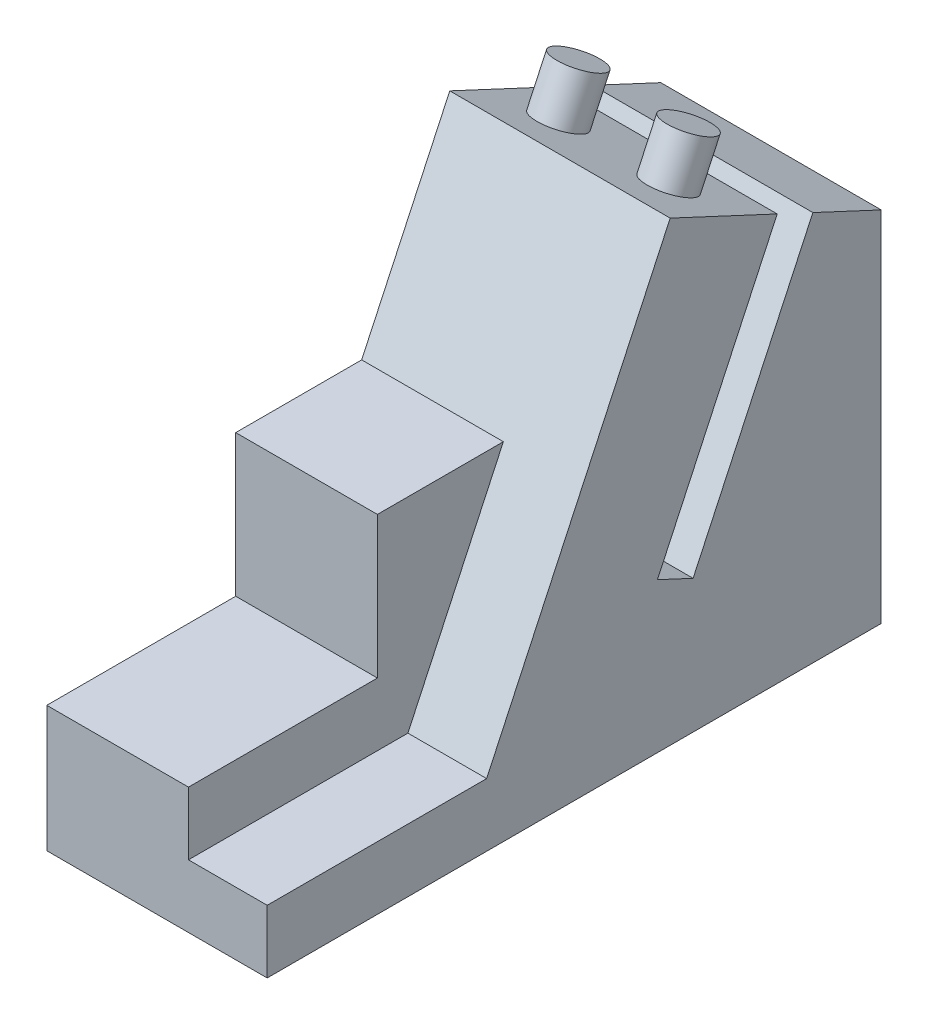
from build123d import *

# Parameters (mm, degrees)
BOSS_EXTRUDE1_DEPTH = 28
CUT_EXTRUDE1_DEPTH  = 10
SKETCH3_R           = 3
BOSS_EXTRUDE2_DEPTH = 6


with BuildPart() as part:
    # Sketch1 → Boss-Extrude1 (new body)
    with BuildSketch(Plane(origin=(0, 0, 0), x_dir=(0, 0, -1), z_dir=(1, 0, 0))):
        Polygon((0, 0), (78, 0), (78, 45.498936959), (69.317539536, 49.547634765), (54.103282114, 16.920554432), (49.571743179, 19.033645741), (64.786000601, 51.660726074), (51.191383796, 58), (40, 34), (24, 34), (24, 16), (0, 16), align=None)
    extrude(amount=BOSS_EXTRUDE1_DEPTH)

    # Sketch2 → Cut-Extrude1 (cut)
    with BuildSketch(Plane(origin=(28, 0, 0), x_dir=(0, 0, -1), z_dir=(1, 0, 0))):
        Polygon((40, 34), (27.876000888, 8), (0, 8), (-13.819753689, 42.331908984), (43.284483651, 41.04359792), align=None)
    extrude(amount=-CUT_EXTRUDE1_DEPTH, mode=Mode.SUBTRACT)

    # Sketch3 → Boss-Extrude2 (add)
    with BuildSketch(Plane(origin=(0, 67.248278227, -31.358387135), x_dir=(1, 0, 0), z_dir=(0, 0.9063077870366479, -0.4226182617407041))):
        with Locations(Location((7, 29.383290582, 0), (0, 0, 90))):
            Circle(SKETCH3_R)
        with Locations(Location((21, 29.383290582, 0), (0, 0, 90))):
            Circle(SKETCH3_R)
    extrude(amount=BOSS_EXTRUDE2_DEPTH)


solid = part.part
